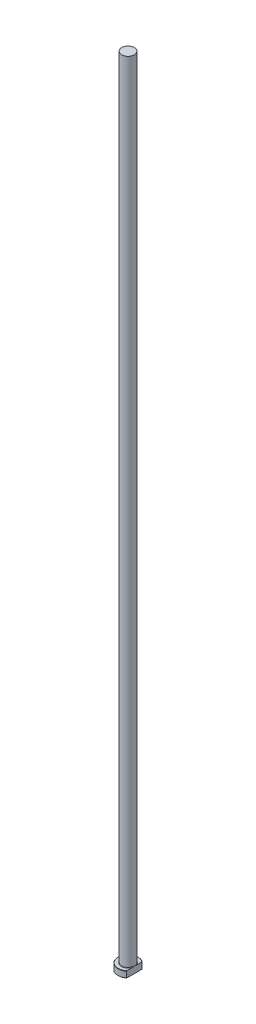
ISO-10303-21;
HEADER;
FILE_DESCRIPTION(('STEP AP214'),'2;1');
FILE_NAME('part.step','',(''),(''),'','','');
FILE_SCHEMA(('AUTOMOTIVE_DESIGN { 1 0 10303 214 1 1 1 1 }'));
ENDSEC;
DATA;
#1=APPLICATION_CONTEXT('core data for automotive mechanical design processes');
#2=APPLICATION_PROTOCOL_DEFINITION('international standard','automotive_design',2000,#1);
#3=PRODUCT_CONTEXT('',#1,'mechanical');
#4=PRODUCT('Part','Part','',(#3));
#5=PRODUCT_RELATED_PRODUCT_CATEGORY('part','',(#4));
#6=PRODUCT_DEFINITION_FORMATION('','',#4);
#7=PRODUCT_DEFINITION_CONTEXT('part definition',#1,'design');
#8=PRODUCT_DEFINITION('design','',#6,#7);
#9=PRODUCT_DEFINITION_SHAPE('','',#8);
#10=(LENGTH_UNIT() NAMED_UNIT(*) SI_UNIT(.MILLI.,.METRE.));
#11=(NAMED_UNIT(*) PLANE_ANGLE_UNIT() SI_UNIT($,.RADIAN.));
#12=(NAMED_UNIT(*) SI_UNIT($,.STERADIAN.) SOLID_ANGLE_UNIT());
#13=UNCERTAINTY_MEASURE_WITH_UNIT(LENGTH_MEASURE(1.E-05),#10,'distance_accuracy_value','');
#14=(GEOMETRIC_REPRESENTATION_CONTEXT(3) GLOBAL_UNCERTAINTY_ASSIGNED_CONTEXT((#13)) GLOBAL_UNIT_ASSIGNED_CONTEXT((#10,
#11,#12)) REPRESENTATION_CONTEXT('',''));
#15=CARTESIAN_POINT('',(0.,0.,0.));
#16=DIRECTION('',(0.,0.,1.));
#17=DIRECTION('',(1.,0.,0.));
#18=AXIS2_PLACEMENT_3D('',#15,#16,#17);
#19=CARTESIAN_POINT('',(0.,0.,0.));
#20=DIRECTION('',(0.,-1.,0.));
#21=DIRECTION('',(0.,0.,-1.));
#22=AXIS2_PLACEMENT_3D('',#19,#20,#21);
#23=PLANE('',#22);
#24=CARTESIAN_POINT('',(0.,0.,0.));
#25=DIRECTION('',(0.,-1.,0.));
#26=DIRECTION('',(0.,0.,-1.));
#27=AXIS2_PLACEMENT_3D('',#24,#25,#26);
#28=CIRCLE('',#27,7.79999999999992);
#29=CARTESIAN_POINT('',(4.99999999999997,0.,5.98665181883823));
#30=VERTEX_POINT('',#29);
#31=CARTESIAN_POINT('',(4.99999999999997,0.,-5.98665181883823));
#32=VERTEX_POINT('',#31);
#33=EDGE_CURVE('E98',#30,#32,#28,.T.);
#34=ORIENTED_EDGE('',*,*,#33,.T.);
#35=DIRECTION('',(0.,0.,1.));
#36=VECTOR('',#35,1.);
#37=CARTESIAN_POINT('',(4.99999999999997,0.,-6.24499799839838));
#38=LINE('',#37,#36);
#39=EDGE_CURVE('E83',#32,#30,#38,.T.);
#40=ORIENTED_EDGE('',*,*,#39,.T.);
#41=EDGE_LOOP('',(#34,#40));
#42=FACE_BOUND('',#41,.T.);
#43=ADVANCED_FACE('F32',(#42),#23,.T.);
#44=CARTESIAN_POINT('',(0.,259.958771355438,0.));
#45=DIRECTION('',(0.,1.,0.));
#46=DIRECTION('',(0.,0.,1.));
#47=AXIS2_PLACEMENT_3D('',#44,#45,#46);
#48=CYLINDRICAL_SURFACE('',#47,7.99999999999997);
#49=CARTESIAN_POINT('',(0.,4.79999999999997,0.));
#50=DIRECTION('',(0.,1.,0.));
#51=DIRECTION('',(0.,0.,1.));
#52=AXIS2_PLACEMENT_3D('',#49,#50,#51);
#53=CIRCLE('',#52,7.99999999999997);
#54=CARTESIAN_POINT('',(4.99999999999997,4.79999999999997,6.24499799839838));
#55=VERTEX_POINT('',#54);
#56=CARTESIAN_POINT('',(4.99999999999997,4.79999999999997,-6.24499799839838));
#57=VERTEX_POINT('',#56);
#58=EDGE_CURVE('E104',#55,#57,#53,.F.);
#59=ORIENTED_EDGE('',*,*,#58,.T.);
#60=DIRECTION('',(0.,-1.,0.));
#61=VECTOR('',#60,1.);
#62=CARTESIAN_POINT('',(4.99999999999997,630.,-6.24499799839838));
#63=LINE('',#62,#61);
#64=CARTESIAN_POINT('',(4.99999999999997,0.200000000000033,-6.24499799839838));
#65=VERTEX_POINT('',#64);
#66=EDGE_CURVE('E183',#57,#65,#63,.T.);
#67=ORIENTED_EDGE('',*,*,#66,.T.);
#68=CARTESIAN_POINT('',(0.,0.200000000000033,0.));
#69=DIRECTION('',(0.,-1.,0.));
#70=DIRECTION('',(0.,0.,-1.));
#71=AXIS2_PLACEMENT_3D('',#68,#69,#70);
#72=CIRCLE('',#71,7.99999999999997);
#73=CARTESIAN_POINT('',(4.99999999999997,0.200000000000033,6.24499799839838));
#74=VERTEX_POINT('',#73);
#75=EDGE_CURVE('E100',#65,#74,#72,.F.);
#76=ORIENTED_EDGE('',*,*,#75,.T.);
#77=DIRECTION('',(0.,-1.,0.));
#78=VECTOR('',#77,1.);
#79=CARTESIAN_POINT('',(4.99999999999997,630.,6.24499799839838));
#80=LINE('',#79,#78);
#81=EDGE_CURVE('E93',#55,#74,#80,.T.);
#82=ORIENTED_EDGE('',*,*,#81,.F.);
#83=EDGE_LOOP('',(#59,#67,#76,#82));
#84=FACE_BOUND('',#83,.T.);
#85=ADVANCED_FACE('F158',(#84),#48,.T.);
#86=CARTESIAN_POINT('',(-7.99999999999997,5.,0.));
#87=DIRECTION('',(0.,1.,0.));
#88=DIRECTION('',(0.,0.,1.));
#89=AXIS2_PLACEMENT_3D('',#86,#87,#88);
#90=PLANE('',#89);
#91=CARTESIAN_POINT('',(0.,5.,0.));
#92=DIRECTION('',(0.,1.,0.));
#93=DIRECTION('',(0.,0.,1.));
#94=AXIS2_PLACEMENT_3D('',#91,#92,#93);
#95=CIRCLE('',#94,7.79999999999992);
#96=CARTESIAN_POINT('',(4.99999999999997,5.,-5.98665181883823));
#97=VERTEX_POINT('',#96);
#98=CARTESIAN_POINT('',(4.99999999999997,5.,5.98665181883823));
#99=VERTEX_POINT('',#98);
#100=EDGE_CURVE('E178',#97,#99,#95,.T.);
#101=ORIENTED_EDGE('',*,*,#100,.T.);
#102=DIRECTION('',(0.,0.,-1.));
#103=VECTOR('',#102,1.);
#104=CARTESIAN_POINT('',(4.99999999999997,5.,0.));
#105=LINE('',#104,#103);
#106=CARTESIAN_POINT('',(4.99999999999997,4.99999999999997,1.75783958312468));
#107=VERTEX_POINT('',#106);
#108=EDGE_CURVE('E57',#99,#107,#105,.T.);
#109=ORIENTED_EDGE('',*,*,#108,.T.);
#110=CARTESIAN_POINT('',(0.,5.,0.));
#111=DIRECTION('',(0.,1.,0.));
#112=DIRECTION('',(0.,0.,1.));
#113=AXIS2_PLACEMENT_3D('',#110,#111,#112);
#114=CIRCLE('',#113,5.29999999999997);
#115=CARTESIAN_POINT('',(4.99999999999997,4.99999999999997,-1.75783958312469));
#116=VERTEX_POINT('',#115);
#117=EDGE_CURVE('E107',#107,#116,#114,.F.);
#118=ORIENTED_EDGE('',*,*,#117,.T.);
#119=EDGE_CURVE('E136',#116,#97,#105,.T.);
#120=ORIENTED_EDGE('',*,*,#119,.T.);
#121=EDGE_LOOP('',(#101,#109,#118,#120));
#122=FACE_BOUND('',#121,.T.);
#123=ADVANCED_FACE('F147',(#122),#90,.T.);
#124=CARTESIAN_POINT('',(0.,5.,0.));
#125=DIRECTION('',(0.,-1.,0.));
#126=DIRECTION('',(0.,0.,-1.));
#127=AXIS2_PLACEMENT_3D('',#124,#125,#126);
#128=CONICAL_SURFACE('',#127,7.79999999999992,0.785398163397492);
#129=ORIENTED_EDGE('',*,*,#58,.F.);
#130=CARTESIAN_POINT('',(4.99999999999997,-1.82162423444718,13.7401563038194));
#131=CARTESIAN_POINT('',(4.99999999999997,-1.61889813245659,13.5244204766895));
#132=CARTESIAN_POINT('',(4.99999999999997,-1.41646387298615,13.3084101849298));
#133=CARTESIAN_POINT('',(4.99999999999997,-1.01227657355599,12.8757508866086));
#134=CARTESIAN_POINT('',(4.99999999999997,-0.810523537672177,12.65910187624));
#135=CARTESIAN_POINT('',(4.99999999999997,-0.206157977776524,12.0077661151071));
#136=CARTESIAN_POINT('',(4.99999999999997,0.195280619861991,11.571988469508));
#137=CARTESIAN_POINT('',(4.99999999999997,1.00388282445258,10.6856136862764));
#138=CARTESIAN_POINT('',(4.99999999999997,1.41093902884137,10.234918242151));
#139=CARTESIAN_POINT('',(4.99999999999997,2.01658324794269,9.55471676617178));
#140=CARTESIAN_POINT('',(4.99999999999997,2.21758236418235,9.32735800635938));
#141=CARTESIAN_POINT('',(4.99999999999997,2.61761142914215,8.87091599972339));
#142=CARTESIAN_POINT('',(4.99999999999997,2.81664139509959,8.6418327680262));
#143=CARTESIAN_POINT('',(4.99999999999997,3.2121734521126,8.18170099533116));
#144=CARTESIAN_POINT('',(4.99999999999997,3.40867681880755,7.95065355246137));
#145=CARTESIAN_POINT('',(4.99999999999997,3.79865427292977,7.48599989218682));
#146=CARTESIAN_POINT('',(4.99999999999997,3.99212827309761,7.25239360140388));
#147=CARTESIAN_POINT('',(4.99999999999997,4.3755816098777,6.78155890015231));
#148=CARTESIAN_POINT('',(4.99999999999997,4.56555334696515,6.54432428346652));
#149=CARTESIAN_POINT('',(4.99999999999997,4.9404213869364,6.06589574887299));
#150=CARTESIAN_POINT('',(4.99999999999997,5.12531810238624,5.82470215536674));
#151=CARTESIAN_POINT('',(4.99999999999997,5.48653546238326,5.33972956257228));
#152=CARTESIAN_POINT('',(4.99999999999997,5.66292392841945,5.09600137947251));
#153=CARTESIAN_POINT('',(4.99999999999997,6.00675382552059,4.60213647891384));
#154=CARTESIAN_POINT('',(4.99999999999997,6.17419169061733,4.35199726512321));
#155=CARTESIAN_POINT('',(4.99999999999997,6.49592993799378,3.84445040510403));
#156=CARTESIAN_POINT('',(4.99999999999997,6.65027272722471,3.5870701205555));
#157=CARTESIAN_POINT('',(4.99999999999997,6.86813414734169,3.19356592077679));
#158=CARTESIAN_POINT('',(4.99999999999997,6.9384553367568,3.06120993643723));
#159=CARTESIAN_POINT('',(4.99999999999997,7.07360441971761,2.7937331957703));
#160=CARTESIAN_POINT('',(4.99999999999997,7.1384331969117,2.65861288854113));
#161=CARTESIAN_POINT('',(4.99999999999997,7.26869642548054,2.36936389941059));
#162=CARTESIAN_POINT('',(4.99999999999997,7.33331212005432,2.21486278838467));
#163=CARTESIAN_POINT('',(4.99999999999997,7.45243473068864,1.90194073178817));
#164=CARTESIAN_POINT('',(4.99999999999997,7.5069400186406,1.74351915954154));
#165=CARTESIAN_POINT('',(4.99999999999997,7.60343746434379,1.42384276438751));
#166=CARTESIAN_POINT('',(4.99999999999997,7.64549910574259,1.26260921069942));
#167=CARTESIAN_POINT('',(4.99999999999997,7.71543089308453,0.937062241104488));
#168=CARTESIAN_POINT('',(4.99999999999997,7.74330266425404,0.772749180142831));
#169=CARTESIAN_POINT('',(4.99999999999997,7.78344284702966,0.439876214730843));
#170=CARTESIAN_POINT('',(4.99999999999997,7.79548961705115,0.271289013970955));
#171=CARTESIAN_POINT('',(4.99999999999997,7.80240809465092,-0.0662275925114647));
#172=CARTESIAN_POINT('',(4.99999999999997,7.79728142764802,-0.235156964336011));
#173=CARTESIAN_POINT('',(4.99999999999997,7.77017954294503,-0.572209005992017));
#174=CARTESIAN_POINT('',(4.99999999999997,7.74814735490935,-0.74032700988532));
#175=CARTESIAN_POINT('',(4.99999999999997,7.68863212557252,-1.07379849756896));
#176=CARTESIAN_POINT('',(4.99999999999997,7.65114437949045,-1.23915112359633));
#177=CARTESIAN_POINT('',(4.99999999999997,7.54734433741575,-1.62344926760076));
#178=CARTESIAN_POINT('',(4.99999999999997,7.475535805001,-1.84089917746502));
#179=CARTESIAN_POINT('',(4.99999999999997,7.31300119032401,-2.26856946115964));
#180=CARTESIAN_POINT('',(4.99999999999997,7.22226460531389,-2.47878574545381));
#181=CARTESIAN_POINT('',(4.99999999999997,7.07492970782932,-2.79014067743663));
#182=CARTESIAN_POINT('',(4.99999999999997,7.02362278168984,-2.89384077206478));
#183=CARTESIAN_POINT('',(4.99999999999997,6.91783840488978,-3.09961626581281));
#184=CARTESIAN_POINT('',(4.99999999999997,6.86336091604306,-3.20169164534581));
#185=CARTESIAN_POINT('',(4.99999999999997,6.75169048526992,-3.40428995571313));
#186=CARTESIAN_POINT('',(4.99999999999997,6.69449856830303,-3.50481345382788));
#187=CARTESIAN_POINT('',(4.99999999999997,6.57774196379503,-3.70446206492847));
#188=CARTESIAN_POINT('',(4.99999999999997,6.51817739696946,-3.80358724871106));
#189=CARTESIAN_POINT('',(4.99999999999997,6.30853654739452,-4.1443576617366));
#190=CARTESIAN_POINT('',(4.99999999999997,6.15326588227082,-4.3828135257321));
#191=CARTESIAN_POINT('',(4.99999999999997,5.83377190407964,-4.85367607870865));
#192=CARTESIAN_POINT('',(4.99999999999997,5.66954595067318,-5.08608095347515));
#193=CARTESIAN_POINT('',(4.99999999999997,5.33431698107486,-5.5462855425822));
#194=CARTESIAN_POINT('',(4.99999999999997,5.16330740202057,-5.77408045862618));
#195=CARTESIAN_POINT('',(4.99999999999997,4.81629923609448,-6.22578157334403));
#196=CARTESIAN_POINT('',(4.99999999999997,4.64030119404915,-6.44968819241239));
#197=CARTESIAN_POINT('',(4.99999999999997,4.28368615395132,-6.89532578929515));
#198=CARTESIAN_POINT('',(4.99999999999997,4.1030528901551,-7.11704371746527));
#199=CARTESIAN_POINT('',(4.99999999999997,3.73870710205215,-7.55793799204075));
#200=CARTESIAN_POINT('',(4.99999999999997,3.55499450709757,-7.77711427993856));
#201=CARTESIAN_POINT('',(4.99999999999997,3.18521083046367,-8.21325328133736));
#202=CARTESIAN_POINT('',(4.99999999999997,2.99914113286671,-8.43021717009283));
#203=CARTESIAN_POINT('',(4.99999999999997,2.62499812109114,-8.86241167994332));
#204=CARTESIAN_POINT('',(4.99999999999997,2.43692478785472,-9.07764228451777));
#205=CARTESIAN_POINT('',(4.99999999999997,1.91463404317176,-9.67075518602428));
#206=CARTESIAN_POINT('',(4.99999999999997,1.57868086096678,-10.0471086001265));
#207=CARTESIAN_POINT('',(4.99999999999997,0.903003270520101,-10.7965122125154));
#208=CARTESIAN_POINT('',(4.99999999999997,0.563278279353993,-11.1695618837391));
#209=CARTESIAN_POINT('',(4.99999999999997,-0.116149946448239,-11.9100168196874));
#210=CARTESIAN_POINT('',(4.99999999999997,-0.455830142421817,-12.2774432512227));
#211=CARTESIAN_POINT('',(4.99999999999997,-1.13728640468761,-13.0102135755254));
#212=CARTESIAN_POINT('',(4.99999999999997,-1.47906204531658,-13.3755578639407));
#213=CARTESIAN_POINT('',(4.99999999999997,-1.82162423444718,-13.7401563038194));
#214=B_SPLINE_CURVE_WITH_KNOTS('',3,(#130,#131,#132,#133,#134,#135,#136,#137,#138,#139,#140,
#141,#142,#143,#144,#145,#146,#147,#148,#149,#150,#151,#152,#153,#154,#155,#156,#157,#158,#159,
#160,#161,#162,#163,#164,#165,#166,#167,#168,#169,#170,#171,#172,#173,#174,#175,#176,#177,#178,
#179,#180,#181,#182,#183,#184,#185,#186,#187,#188,#189,#190,#191,#192,#193,#194,#195,#196,#197,
#198,#199,#200,#201,#202,#203,#204,#205,#206,#207,#208,#209,#210,#211,#212,#213),.UNSPECIFIED.,
.F.,.F.,(4,2,2,2,2,2,2,2,2,2,2,2,2,2,2,2,2,2,2,2,2,2,2,2,2,2,2,2,2,2,2,2,2,2,2,2,2,2,2,2,2,4),
(0.,0.888120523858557,1.77624635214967,3.55372511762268,5.37559481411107,6.28598924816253,
7.19637570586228,8.10628289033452,9.01621623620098,9.92793449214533,10.8395784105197,
11.7420025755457,12.6447836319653,13.5445196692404,13.9940505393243,14.4435089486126,
14.9456212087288,15.4478142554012,15.947147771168,16.4464240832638,16.952621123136,
17.4587702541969,17.966632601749,18.4746496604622,19.1604516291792,19.8466351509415,
20.1936870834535,20.5407431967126,20.8876692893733,21.2345777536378,22.0879097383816,
22.9414946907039,23.79592661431,24.6502655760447,25.5081848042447,26.3661237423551,
27.2235803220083,28.0810450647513,29.5944656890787,31.1081235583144,32.6092678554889,
34.1101167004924),.UNSPECIFIED.);
#215=EDGE_CURVE('E135',#55,#99,#214,.T.);
#216=ORIENTED_EDGE('',*,*,#215,.T.);
#217=ORIENTED_EDGE('',*,*,#100,.F.);
#218=EDGE_CURVE('E127',#97,#57,#214,.T.);
#219=ORIENTED_EDGE('',*,*,#218,.T.);
#220=EDGE_LOOP('',(#129,#216,#217,#219));
#221=FACE_BOUND('',#220,.T.);
#222=ADVANCED_FACE('F143',(#221),#128,.T.);
#223=CARTESIAN_POINT('',(0.,0.200000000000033,0.));
#224=DIRECTION('',(0.,1.,0.));
#225=DIRECTION('',(0.,0.,1.));
#226=AXIS2_PLACEMENT_3D('',#223,#224,#225);
#227=CONICAL_SURFACE('',#226,7.99999999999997,0.785398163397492);
#228=ORIENTED_EDGE('',*,*,#75,.F.);
#229=CARTESIAN_POINT('',(4.99999999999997,6.82162423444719,-13.7401563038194));
#230=CARTESIAN_POINT('',(4.99999999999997,6.61889813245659,-13.5244204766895));
#231=CARTESIAN_POINT('',(4.99999999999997,6.41646387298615,-13.3084101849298));
#232=CARTESIAN_POINT('',(4.99999999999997,6.01227657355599,-12.8757508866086));
#233=CARTESIAN_POINT('',(4.99999999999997,5.81052353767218,-12.65910187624));
#234=CARTESIAN_POINT('',(4.99999999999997,5.20615797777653,-12.0077661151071));
#235=CARTESIAN_POINT('',(4.99999999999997,4.80471938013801,-11.571988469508));
#236=CARTESIAN_POINT('',(4.99999999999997,3.99611717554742,-10.6856136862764));
#237=CARTESIAN_POINT('',(4.99999999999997,3.58906097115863,-10.234918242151));
#238=CARTESIAN_POINT('',(4.99999999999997,2.98341675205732,-9.55471676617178));
#239=CARTESIAN_POINT('',(4.99999999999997,2.78241763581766,-9.32735800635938));
#240=CARTESIAN_POINT('',(4.99999999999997,2.38238857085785,-8.87091599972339));
#241=CARTESIAN_POINT('',(4.99999999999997,2.18335860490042,-8.6418327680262));
#242=CARTESIAN_POINT('',(4.99999999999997,1.78782654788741,-8.18170099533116));
#243=CARTESIAN_POINT('',(4.99999999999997,1.59132318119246,-7.95065355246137));
#244=CARTESIAN_POINT('',(4.99999999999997,1.20134572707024,-7.48599989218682));
#245=CARTESIAN_POINT('',(4.99999999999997,1.00787172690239,-7.25239360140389));
#246=CARTESIAN_POINT('',(4.99999999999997,0.62441839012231,-6.78155890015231));
#247=CARTESIAN_POINT('',(4.99999999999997,0.434446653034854,-6.54432428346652));
#248=CARTESIAN_POINT('',(4.99999999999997,0.0595786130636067,-6.06589574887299));
#249=CARTESIAN_POINT('',(4.99999999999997,-0.12531810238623,-5.82470215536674));
#250=CARTESIAN_POINT('',(4.99999999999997,-0.486535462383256,-5.33972956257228));
#251=CARTESIAN_POINT('',(4.99999999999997,-0.662923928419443,-5.09600137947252));
#252=CARTESIAN_POINT('',(4.99999999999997,-1.00675382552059,-4.60213647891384));
#253=CARTESIAN_POINT('',(4.99999999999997,-1.17419169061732,-4.35199726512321));
#254=CARTESIAN_POINT('',(4.99999999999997,-1.49592993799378,-3.84445040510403));
#255=CARTESIAN_POINT('',(4.99999999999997,-1.65027272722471,-3.5870701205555));
#256=CARTESIAN_POINT('',(4.99999999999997,-1.86813414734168,-3.19356592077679));
#257=CARTESIAN_POINT('',(4.99999999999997,-1.93845533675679,-3.06120993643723));
#258=CARTESIAN_POINT('',(4.99999999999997,-2.07360441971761,-2.7937331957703));
#259=CARTESIAN_POINT('',(4.99999999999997,-2.1384331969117,-2.65861288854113));
#260=CARTESIAN_POINT('',(4.99999999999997,-2.26869642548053,-2.36936389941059));
#261=CARTESIAN_POINT('',(4.99999999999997,-2.33331212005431,-2.21486278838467));
#262=CARTESIAN_POINT('',(4.99999999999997,-2.45243473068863,-1.90194073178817));
#263=CARTESIAN_POINT('',(4.99999999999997,-2.50694001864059,-1.74351915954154));
#264=CARTESIAN_POINT('',(4.99999999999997,-2.60343746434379,-1.42384276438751));
#265=CARTESIAN_POINT('',(4.99999999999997,-2.64549910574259,-1.26260921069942));
#266=CARTESIAN_POINT('',(4.99999999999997,-2.71543089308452,-0.937062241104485));
#267=CARTESIAN_POINT('',(4.99999999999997,-2.74330266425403,-0.772749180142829));
#268=CARTESIAN_POINT('',(4.99999999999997,-2.78344284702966,-0.439876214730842));
#269=CARTESIAN_POINT('',(4.99999999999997,-2.79548961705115,-0.271289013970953));
#270=CARTESIAN_POINT('',(4.99999999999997,-2.80240809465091,0.0662275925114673));
#271=CARTESIAN_POINT('',(4.99999999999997,-2.79728142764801,0.235156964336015));
#272=CARTESIAN_POINT('',(4.99999999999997,-2.77017954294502,0.572209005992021));
#273=CARTESIAN_POINT('',(4.99999999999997,-2.74814735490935,0.740327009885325));
#274=CARTESIAN_POINT('',(4.99999999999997,-2.68863212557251,1.07379849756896));
#275=CARTESIAN_POINT('',(4.99999999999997,-2.65114437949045,1.23915112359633));
#276=CARTESIAN_POINT('',(4.99999999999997,-2.54734433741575,1.62344926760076));
#277=CARTESIAN_POINT('',(4.99999999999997,-2.475535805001,1.84089917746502));
#278=CARTESIAN_POINT('',(4.99999999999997,-2.31300119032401,2.26856946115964));
#279=CARTESIAN_POINT('',(4.99999999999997,-2.22226460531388,2.47878574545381));
#280=CARTESIAN_POINT('',(4.99999999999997,-2.07492970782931,2.79014067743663));
#281=CARTESIAN_POINT('',(4.99999999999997,-2.02362278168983,2.89384077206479));
#282=CARTESIAN_POINT('',(4.99999999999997,-1.91783840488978,3.09961626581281));
#283=CARTESIAN_POINT('',(4.99999999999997,-1.86336091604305,3.20169164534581));
#284=CARTESIAN_POINT('',(4.99999999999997,-1.75169048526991,3.40428995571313));
#285=CARTESIAN_POINT('',(4.99999999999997,-1.69449856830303,3.50481345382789));
#286=CARTESIAN_POINT('',(4.99999999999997,-1.57774196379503,3.70446206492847));
#287=CARTESIAN_POINT('',(4.99999999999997,-1.51817739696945,3.80358724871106));
#288=CARTESIAN_POINT('',(4.99999999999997,-1.30853654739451,4.14435766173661));
#289=CARTESIAN_POINT('',(4.99999999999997,-1.15326588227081,4.38281352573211));
#290=CARTESIAN_POINT('',(4.99999999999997,-0.833771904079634,4.85367607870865));
#291=CARTESIAN_POINT('',(4.99999999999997,-0.669545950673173,5.08608095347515));
#292=CARTESIAN_POINT('',(4.99999999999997,-0.334316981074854,5.5462855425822));
#293=CARTESIAN_POINT('',(4.99999999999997,-0.163307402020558,5.77408045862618));
#294=CARTESIAN_POINT('',(4.99999999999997,0.183700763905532,6.22578157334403));
#295=CARTESIAN_POINT('',(4.99999999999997,0.359698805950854,6.4496881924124));
#296=CARTESIAN_POINT('',(4.99999999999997,0.716313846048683,6.89532578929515));
#297=CARTESIAN_POINT('',(4.99999999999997,0.896947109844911,7.11704371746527));
#298=CARTESIAN_POINT('',(4.99999999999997,1.26129289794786,7.55793799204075));
#299=CARTESIAN_POINT('',(4.99999999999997,1.44500549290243,7.77711427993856));
#300=CARTESIAN_POINT('',(4.99999999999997,1.81478916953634,8.21325328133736));
#301=CARTESIAN_POINT('',(4.99999999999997,2.0008588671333,8.43021717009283));
#302=CARTESIAN_POINT('',(4.99999999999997,2.37500187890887,8.86241167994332));
#303=CARTESIAN_POINT('',(4.99999999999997,2.56307521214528,9.07764228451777));
#304=CARTESIAN_POINT('',(4.99999999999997,3.08536595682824,9.67075518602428));
#305=CARTESIAN_POINT('',(4.99999999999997,3.42131913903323,10.0471086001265));
#306=CARTESIAN_POINT('',(4.99999999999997,4.0969967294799,10.7965122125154));
#307=CARTESIAN_POINT('',(4.99999999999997,4.43672172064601,11.1695618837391));
#308=CARTESIAN_POINT('',(4.99999999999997,5.11614994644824,11.9100168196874));
#309=CARTESIAN_POINT('',(4.99999999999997,5.45583014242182,12.2774432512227));
#310=CARTESIAN_POINT('',(4.99999999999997,6.13728640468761,13.0102135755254));
#311=CARTESIAN_POINT('',(4.99999999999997,6.47906204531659,13.3755578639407));
#312=CARTESIAN_POINT('',(4.99999999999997,6.82162423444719,13.7401563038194));
#313=B_SPLINE_CURVE_WITH_KNOTS('',3,(#229,#230,#231,#232,#233,#234,#235,#236,#237,#238,#239,
#240,#241,#242,#243,#244,#245,#246,#247,#248,#249,#250,#251,#252,#253,#254,#255,#256,#257,#258,
#259,#260,#261,#262,#263,#264,#265,#266,#267,#268,#269,#270,#271,#272,#273,#274,#275,#276,#277,
#278,#279,#280,#281,#282,#283,#284,#285,#286,#287,#288,#289,#290,#291,#292,#293,#294,#295,#296,
#297,#298,#299,#300,#301,#302,#303,#304,#305,#306,#307,#308,#309,#310,#311,#312),.UNSPECIFIED.,
.F.,.F.,(4,2,2,2,2,2,2,2,2,2,2,2,2,2,2,2,2,2,2,2,2,2,2,2,2,2,2,2,2,2,2,2,2,2,2,2,2,2,2,2,2,4),
(0.,0.888120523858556,1.77624635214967,3.55372511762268,5.37559481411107,6.28598924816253,
7.19637570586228,8.10628289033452,9.01621623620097,9.92793449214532,10.8395784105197,
11.7420025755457,12.6447836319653,13.5445196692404,13.9940505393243,14.4435089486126,
14.9456212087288,15.4478142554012,15.947147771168,16.4464240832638,16.952621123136,
17.4587702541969,17.966632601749,18.4746496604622,19.1604516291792,19.8466351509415,
20.1936870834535,20.5407431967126,20.8876692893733,21.2345777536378,22.0879097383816,
22.9414946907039,23.79592661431,24.6502655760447,25.5081848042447,26.3661237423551,
27.2235803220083,28.0810450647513,29.5944656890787,31.1081235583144,32.6092678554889,
34.1101167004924),.UNSPECIFIED.);
#314=EDGE_CURVE('E86',#65,#32,#313,.T.);
#315=ORIENTED_EDGE('',*,*,#314,.T.);
#316=ORIENTED_EDGE('',*,*,#33,.F.);
#317=EDGE_CURVE('E89',#30,#74,#313,.T.);
#318=ORIENTED_EDGE('',*,*,#317,.T.);
#319=EDGE_LOOP('',(#228,#315,#316,#318));
#320=FACE_BOUND('',#319,.T.);
#321=ADVANCED_FACE('F97',(#320),#227,.T.);
#322=CARTESIAN_POINT('',(0.,5.29999999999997,0.));
#323=DIRECTION('',(0.,1.,0.));
#324=DIRECTION('',(0.,0.,1.));
#325=AXIS2_PLACEMENT_3D('',#322,#323,#324);
#326=TOROIDAL_SURFACE('',#325,5.29999999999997,0.3);
#327=CARTESIAN_POINT('',(4.99999999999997,5.29999999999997,0.));
#328=CARTESIAN_POINT('',(4.99999999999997,5.30000062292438,1.31470000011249E-10));
#329=CARTESIAN_POINT('',(4.99999999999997,5.30000124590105,-2.52759208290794E-07));
#330=CARTESIAN_POINT('',(4.99999999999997,5.30000240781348,-9.4716432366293E-07));
#331=CARTESIAN_POINT('',(4.99999999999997,5.30000293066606,-1.40594035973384E-06));
#332=CARTESIAN_POINT('',(4.99999999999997,5.30000402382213,-2.50637603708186E-06));
#333=CARTESIAN_POINT('',(4.99999999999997,5.30000457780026,-3.16588904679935E-06));
#334=CARTESIAN_POINT('',(4.99999999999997,5.30000556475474,-4.52859961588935E-06));
#335=CARTESIAN_POINT('',(4.99999999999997,5.30000600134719,-5.22939444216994E-06));
#336=CARTESIAN_POINT('',(4.99999999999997,5.30000763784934,-7.96121978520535E-06));
#337=CARTESIAN_POINT('',(4.99999999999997,5.30000875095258,-1.0047740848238E-05));
#338=CARTESIAN_POINT('',(4.99999999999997,5.30001056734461,-1.41660873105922E-05));
#339=CARTESIAN_POINT('',(4.99999999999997,5.30001129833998,-1.61861783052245E-05));
#340=CARTESIAN_POINT('',(4.99999999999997,5.30001439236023,-2.47865739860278E-05));
#341=CARTESIAN_POINT('',(4.99999999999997,5.30001672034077,-3.1383028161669E-05));
#342=CARTESIAN_POINT('',(4.99999999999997,5.30002012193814,-4.38084218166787E-05));
#343=CARTESIAN_POINT('',(4.99999999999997,5.30002133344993,-4.95992736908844E-05));
#344=CARTESIAN_POINT('',(4.99999999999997,5.30003020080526,-9.27862610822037E-05));
#345=CARTESIAN_POINT('',(4.99999999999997,5.30003696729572,-0.000130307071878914));
#346=CARTESIAN_POINT('',(4.99999999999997,5.30006659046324,-0.000278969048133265));
#347=CARTESIAN_POINT('',(4.99999999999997,5.30009481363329,-0.000389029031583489));
#348=CARTESIAN_POINT('',(4.99999999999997,5.3002050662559,-0.000826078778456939));
#349=CARTESIAN_POINT('',(4.99999999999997,5.30028365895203,-0.0011536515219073));
#350=CARTESIAN_POINT('',(4.99999999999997,5.300599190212,-0.0024592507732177));
#351=CARTESIAN_POINT('',(4.99999999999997,5.30084048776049,-0.00343651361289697));
#352=CARTESIAN_POINT('',(4.99999999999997,5.3018462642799,-0.00752058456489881));
#353=CARTESIAN_POINT('',(4.99999999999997,5.3026052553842,-0.0106283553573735));
#354=CARTESIAN_POINT('',(4.99999999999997,5.30996461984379,-0.0407482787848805));
#355=CARTESIAN_POINT('',(4.99999999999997,5.31658985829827,-0.0677561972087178));
#356=CARTESIAN_POINT('',(4.99999999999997,5.32953319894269,-0.120688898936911));
#357=CARTESIAN_POINT('',(4.99999999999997,5.33585289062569,-0.146613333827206));
#358=CARTESIAN_POINT('',(4.99999999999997,5.34926050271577,-0.201795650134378));
#359=CARTESIAN_POINT('',(4.99999999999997,5.35634306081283,-0.231054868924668));
#360=CARTESIAN_POINT('',(4.99999999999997,5.37050252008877,-0.289917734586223));
#361=CARTESIAN_POINT('',(4.99999999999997,5.37757848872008,-0.319521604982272));
#362=CARTESIAN_POINT('',(4.99999999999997,5.39452602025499,-0.391032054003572));
#363=CARTESIAN_POINT('',(4.99999999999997,5.40434071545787,-0.432952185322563));
#364=CARTESIAN_POINT('',(4.99999999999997,5.42340141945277,-0.51576321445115));
#365=CARTESIAN_POINT('',(4.99999999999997,5.43265559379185,-0.556652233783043));
#366=CARTESIAN_POINT('',(4.99999999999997,5.45710553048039,-0.667075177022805));
#367=CARTESIAN_POINT('',(4.99999999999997,5.47194176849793,-0.736689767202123));
#368=CARTESIAN_POINT('',(4.99999999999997,5.50018229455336,-0.876836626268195));
#369=CARTESIAN_POINT('',(4.99999999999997,5.51357312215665,-0.947371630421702));
#370=CARTESIAN_POINT('',(4.99999999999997,5.53930921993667,-1.09497328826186));
#371=CARTESIAN_POINT('',(4.99999999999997,5.55146217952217,-1.17207432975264));
#372=CARTESIAN_POINT('',(4.99999999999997,5.57239669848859,-1.32672649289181));
#373=CARTESIAN_POINT('',(4.99999999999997,5.58117877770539,-1.40427754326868));
#374=CARTESIAN_POINT('',(4.99999999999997,5.594997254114,-1.5687382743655));
#375=CARTESIAN_POINT('',(4.99999999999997,5.59948802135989,-1.65570044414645));
#376=CARTESIAN_POINT('',(4.99999999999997,5.60018885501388,-1.78535304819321));
#377=CARTESIAN_POINT('',(4.99999999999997,5.59945214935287,-1.82802575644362));
#378=CARTESIAN_POINT('',(4.99999999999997,5.59559364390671,-1.91325081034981));
#379=CARTESIAN_POINT('',(4.99999999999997,5.59247319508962,-1.95580321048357));
#380=CARTESIAN_POINT('',(4.99999999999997,5.5838324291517,-2.03512365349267));
#381=CARTESIAN_POINT('',(4.99999999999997,5.57867386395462,-2.07192937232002));
#382=CARTESIAN_POINT('',(4.99999999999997,5.56543793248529,-2.1452675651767));
#383=CARTESIAN_POINT('',(4.99999999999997,5.55734203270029,-2.18179676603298));
#384=CARTESIAN_POINT('',(4.99999999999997,5.53718005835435,-2.25427226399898));
#385=CARTESIAN_POINT('',(4.99999999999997,5.52507057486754,-2.29020746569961));
#386=CARTESIAN_POINT('',(4.99999999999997,5.50270928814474,-2.34223029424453));
#387=CARTESIAN_POINT('',(4.99999999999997,5.4945781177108,-2.35922314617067));
#388=CARTESIAN_POINT('',(4.99999999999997,5.47657809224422,-2.39224900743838));
#389=CARTESIAN_POINT('',(4.99999999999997,5.46671281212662,-2.40828390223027));
#390=CARTESIAN_POINT('',(4.99999999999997,5.44695893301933,-2.43579467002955));
#391=CARTESIAN_POINT('',(4.99999999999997,5.4374587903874,-2.44754592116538));
#392=CARTESIAN_POINT('',(4.99999999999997,5.41677914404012,-2.46946476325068));
#393=CARTESIAN_POINT('',(4.99999999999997,5.40560543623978,-2.47963758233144));
#394=CARTESIAN_POINT('',(4.99999999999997,5.38617750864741,-2.49393642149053));
#395=CARTESIAN_POINT('',(4.99999999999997,5.37851643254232,-2.49886271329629));
#396=CARTESIAN_POINT('',(4.99999999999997,5.36252740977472,-2.50749953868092));
#397=CARTESIAN_POINT('',(4.99999999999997,5.35419984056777,-2.51121075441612));
#398=CARTESIAN_POINT('',(4.99999999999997,5.33690648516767,-2.51712941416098));
#399=CARTESIAN_POINT('',(4.99999999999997,5.3279345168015,-2.51931927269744));
#400=CARTESIAN_POINT('',(4.99999999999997,5.30973576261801,-2.52185978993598));
#401=CARTESIAN_POINT('',(4.99999999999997,5.30050931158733,-2.52221275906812));
#402=CARTESIAN_POINT('',(4.99999999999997,5.28349166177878,-2.52112455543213));
#403=CARTESIAN_POINT('',(4.99999999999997,5.27568322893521,-2.519931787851));
#404=CARTESIAN_POINT('',(4.99999999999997,5.26036860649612,-2.51628294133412));
#405=CARTESIAN_POINT('',(4.99999999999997,5.25286261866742,-2.51382603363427));
#406=CARTESIAN_POINT('',(4.99999999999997,5.23590266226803,-2.50685484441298));
#407=CARTESIAN_POINT('',(4.99999999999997,5.22661875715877,-2.50192984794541));
#408=CARTESIAN_POINT('',(4.99999999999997,5.20895514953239,-2.49066548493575));
#409=CARTESIAN_POINT('',(4.99999999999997,5.20057756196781,-2.48432291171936));
#410=CARTESIAN_POINT('',(4.99999999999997,5.1798700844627,-2.46645212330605));
#411=CARTESIAN_POINT('',(4.99999999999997,5.1682415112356,-2.45411867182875));
#412=CARTESIAN_POINT('',(4.99999999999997,5.14692461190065,-2.42790849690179));
#413=CARTESIAN_POINT('',(4.99999999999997,5.13723987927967,-2.41402898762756));
#414=CARTESIAN_POINT('',(4.99999999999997,5.11080706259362,-2.37143175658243));
#415=CARTESIAN_POINT('',(4.99999999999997,5.09628770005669,-2.34134703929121));
#416=CARTESIAN_POINT('',(4.99999999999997,5.07130349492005,-2.27940731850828));
#417=CARTESIAN_POINT('',(4.99999999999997,5.06087110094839,-2.24754035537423));
#418=CARTESIAN_POINT('',(4.99999999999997,5.03890359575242,-2.16787245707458));
#419=CARTESIAN_POINT('',(4.99999999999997,5.02913523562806,-2.1195906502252));
#420=CARTESIAN_POINT('',(4.99999999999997,5.01416953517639,-2.02224928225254));
#421=CARTESIAN_POINT('',(4.99999999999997,5.00898637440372,-1.97318778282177));
#422=CARTESIAN_POINT('',(4.99999999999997,5.00220823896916,-1.87635767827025));
#423=CARTESIAN_POINT('',(4.99999999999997,5.00050709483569,-1.82859609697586));
#424=CARTESIAN_POINT('',(4.99999999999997,4.99969104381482,-1.73330165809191));
#425=CARTESIAN_POINT('',(4.99999999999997,5.00056327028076,-1.68576884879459));
#426=CARTESIAN_POINT('',(4.99999999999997,5.0048429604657,-1.57937770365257));
#427=CARTESIAN_POINT('',(4.99999999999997,5.00880932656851,-1.52054285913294));
#428=CARTESIAN_POINT('',(4.99999999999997,5.01925964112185,-1.40312974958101));
#429=CARTESIAN_POINT('',(4.99999999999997,5.02574264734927,-1.34455139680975));
#430=CARTESIAN_POINT('',(4.99999999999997,5.04090087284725,-1.22627662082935));
#431=CARTESIAN_POINT('',(4.99999999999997,5.0496242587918,-1.16658647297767));
#432=CARTESIAN_POINT('',(4.99999999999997,5.06877923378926,-1.04732463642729));
#433=CARTESIAN_POINT('',(4.99999999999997,5.07921523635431,-0.987753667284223));
#434=CARTESIAN_POINT('',(4.99999999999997,5.10551698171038,-0.846936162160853));
#435=CARTESIAN_POINT('',(4.99999999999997,5.12196565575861,-0.765799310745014));
#436=CARTESIAN_POINT('',(4.99999999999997,5.15639716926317,-0.604819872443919));
#437=CARTESIAN_POINT('',(4.99999999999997,5.17436050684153,-0.524973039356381));
#438=CARTESIAN_POINT('',(4.99999999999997,5.20921667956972,-0.374726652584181));
#439=CARTESIAN_POINT('',(4.99999999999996,5.22599388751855,-0.304300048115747));
#440=CARTESIAN_POINT('',(4.99999999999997,5.2519110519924,-0.196907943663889));
#441=CARTESIAN_POINT('',(4.99999999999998,5.26090146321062,-0.159905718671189));
#442=CARTESIAN_POINT('',(4.99999999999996,5.27881854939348,-0.0865164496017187));
#443=CARTESIAN_POINT('',(4.99999999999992,5.28774391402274,-0.0501291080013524));
#444=CARTESIAN_POINT('',(4.99999999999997,5.29739627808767,-0.0106218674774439));
#445=CARTESIAN_POINT('',(4.99999999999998,5.2981568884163,-0.00750762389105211));
#446=CARTESIAN_POINT('',(4.99999999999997,5.2991630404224,-0.00342209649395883));
#447=CARTESIAN_POINT('',(4.99999999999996,5.29940309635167,-0.00244985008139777));
#448=CARTESIAN_POINT('',(4.99999999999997,5.29971711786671,-0.00115049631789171));
#449=CARTESIAN_POINT('',(4.99999999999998,5.299795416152,-0.000824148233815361));
#450=CARTESIAN_POINT('',(4.99999999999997,5.2999053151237,-0.000388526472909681));
#451=CARTESIAN_POINT('',(4.99999999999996,5.29993348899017,-0.0002786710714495));
#452=CARTESIAN_POINT('',(4.99999999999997,5.29996306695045,-0.000130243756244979));
#453=CARTESIAN_POINT('',(4.99999999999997,5.29996982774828,-9.2751137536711E-05));
#454=CARTESIAN_POINT('',(4.99999999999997,5.29997868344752,-4.95929887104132E-05));
#455=CARTESIAN_POINT('',(4.99999999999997,5.29997989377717,-4.38036553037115E-05));
#456=CARTESIAN_POINT('',(4.99999999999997,5.29998329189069,-3.13814183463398E-05));
#457=CARTESIAN_POINT('',(4.99999999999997,5.29998561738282,-2.4786521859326E-05));
#458=CARTESIAN_POINT('',(4.99999999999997,5.29998870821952,-1.61877546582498E-05));
#459=CARTESIAN_POINT('',(4.99999999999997,5.29998943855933,-1.41677768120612E-05));
#460=CARTESIAN_POINT('',(4.99999999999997,5.29999125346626,-1.00495530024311E-05));
#461=CARTESIAN_POINT('',(4.99999999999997,5.29999236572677,-7.96302653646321E-06));
#462=CARTESIAN_POINT('',(4.99999999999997,5.29999400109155,-5.23107415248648E-06));
#463=CARTESIAN_POINT('',(4.99999999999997,5.29999443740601,-4.53021031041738E-06));
#464=CARTESIAN_POINT('',(4.99999999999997,5.29999542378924,-3.16731152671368E-06));
#465=CARTESIAN_POINT('',(4.99999999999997,5.29999597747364,-2.50767725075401E-06));
#466=CARTESIAN_POINT('',(4.99999999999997,5.29999707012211,-1.40695877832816E-06));
#467=CARTESIAN_POINT('',(4.99999999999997,5.29999759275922,-9.48032431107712E-07));
#468=CARTESIAN_POINT('',(4.99999999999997,5.29999875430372,-2.53244317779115E-07));
#469=CARTESIAN_POINT('',(4.99999999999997,5.29999937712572,-1.3145941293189E-10));
#470=CARTESIAN_POINT('',(4.99999999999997,5.29999999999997,0.));
#471=B_SPLINE_CURVE_WITH_KNOTS('',3,(#327,#328,#329,#330,#331,#332,#333,#334,#335,#336,#337,
#338,#339,#340,#341,#342,#343,#344,#345,#346,#347,#348,#349,#350,#351,#352,#353,#354,#355,#356,
#357,#358,#359,#360,#361,#362,#363,#364,#365,#366,#367,#368,#369,#370,#371,#372,#373,#374,#375,
#376,#377,#378,#379,#380,#381,#382,#383,#384,#385,#386,#387,#388,#389,#390,#391,#392,#393,#394,
#395,#396,#397,#398,#399,#400,#401,#402,#403,#404,#405,#406,#407,#408,#409,#410,#411,#412,#413,
#414,#415,#416,#417,#418,#419,#420,#421,#422,#423,#424,#425,#426,#427,#428,#429,#430,#431,#432,
#433,#434,#435,#436,#437,#438,#439,#440,#441,#442,#443,#444,#445,#446,#447,#448,#449,#450,#451,
#452,#453,#454,#455,#456,#457,#458,#459,#460,#461,#462,#463,#464,#465,#466,#467,#468,#469,#470),
.UNSPECIFIED.,.T.,.F.,(4,2,2,2,2,2,2,2,2,2,2,2,2,2,2,2,2,2,2,2,2,2,2,2,2,2,2,2,2,2,2,2,2,2,2,2,
2,2,2,2,2,2,2,2,2,2,2,2,2,2,2,2,2,2,2,2,2,2,2,2,2,2,2,2,2,2,2,2,2,2,2,4),(0.,
1.88939317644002E-06,3.98058917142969E-06,6.54818564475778E-06,9.0240439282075E-06,
1.60938750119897E-05,2.25328198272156E-05,4.34843921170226E-05,6.12120199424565E-05,
0.000175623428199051,0.000516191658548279,0.00152710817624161,0.00454656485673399,
0.0141443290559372,0.0975679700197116,0.177619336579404,0.267931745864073,0.35924502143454,
0.488405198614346,0.614173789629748,0.827694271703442,1.04305715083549,1.27715608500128,
1.51121890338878,1.77214751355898,1.9001350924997,2.02805018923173,2.13945459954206,
2.25157451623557,2.36494894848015,2.4213923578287,2.47772074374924,2.52293802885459,
2.56800219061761,2.59524342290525,2.62246933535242,2.65000494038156,2.67750590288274,
2.70108948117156,2.72468854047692,2.75603978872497,2.78746268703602,2.83802806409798,
2.888686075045,2.98834295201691,3.0887757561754,3.23618650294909,3.38405153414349,
3.52733651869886,3.66990630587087,3.84673903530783,4.02350562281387,4.20444776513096,
4.38586374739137,4.63419556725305,4.87971270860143,5.09690175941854,5.21113882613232,
5.32353360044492,5.33315137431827,5.33615533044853,5.33716246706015,5.33750240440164,
5.33761672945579,5.33763445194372,5.33765539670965,5.33766183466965,5.33766890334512,
5.33767137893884,5.3376739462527,5.33767603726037,5.3376779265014),.UNSPECIFIED.);
#472=CARTESIAN_POINT('',(4.99999999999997,5.29999999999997,0.));
#473=VERTEX_POINT('',#472);
#474=EDGE_CURVE('E11',#116,#473,#471,.T.);
#475=ORIENTED_EDGE('',*,*,#474,.F.);
#476=ORIENTED_EDGE('',*,*,#117,.F.);
#477=CARTESIAN_POINT('',(4.99999999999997,5.29999999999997,0.));
#478=CARTESIAN_POINT('',(4.99999999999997,5.29999937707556,-1.31470067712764E-10));
#479=CARTESIAN_POINT('',(4.99999999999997,5.29999875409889,2.5275920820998E-07));
#480=CARTESIAN_POINT('',(4.99999999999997,5.29999759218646,9.4716432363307E-07));
#481=CARTESIAN_POINT('',(4.99999999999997,5.29999706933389,1.40594035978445E-06));
#482=CARTESIAN_POINT('',(4.99999999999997,5.29999597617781,2.5063760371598E-06));
#483=CARTESIAN_POINT('',(4.99999999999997,5.29999542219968,3.16588904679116E-06));
#484=CARTESIAN_POINT('',(4.99999999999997,5.2999944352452,4.52859961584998E-06));
#485=CARTESIAN_POINT('',(4.99999999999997,5.29999399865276,5.22939444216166E-06));
#486=CARTESIAN_POINT('',(4.99999999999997,5.2999923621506,7.96121978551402E-06));
#487=CARTESIAN_POINT('',(4.99999999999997,5.29999124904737,1.00477408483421E-05));
#488=CARTESIAN_POINT('',(4.99999999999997,5.29998943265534,1.41660873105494E-05));
#489=CARTESIAN_POINT('',(4.99999999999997,5.29998870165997,1.61861783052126E-05));
#490=CARTESIAN_POINT('',(4.99999999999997,5.29998560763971,2.47865739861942E-05));
#491=CARTESIAN_POINT('',(4.99999999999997,5.29998327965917,3.13830281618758E-05));
#492=CARTESIAN_POINT('',(4.99999999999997,5.2999798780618,4.38084218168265E-05));
#493=CARTESIAN_POINT('',(4.99999999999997,5.29997866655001,4.95992736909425E-05));
#494=CARTESIAN_POINT('',(4.99999999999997,5.29996979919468,9.27862610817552E-05));
#495=CARTESIAN_POINT('',(4.99999999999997,5.29996303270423,0.000130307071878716));
#496=CARTESIAN_POINT('',(4.99999999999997,5.2999334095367,0.000278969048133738));
#497=CARTESIAN_POINT('',(4.99999999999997,5.29990518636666,0.000389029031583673));
#498=CARTESIAN_POINT('',(4.99999999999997,5.29979493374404,0.000826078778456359));
#499=CARTESIAN_POINT('',(4.99999999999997,5.29971634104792,0.00115365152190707));
#500=CARTESIAN_POINT('',(4.99999999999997,5.29940080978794,0.00245925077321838));
#501=CARTESIAN_POINT('',(4.99999999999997,5.29915951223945,0.00343651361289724));
#502=CARTESIAN_POINT('',(4.99999999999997,5.29815373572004,0.00752058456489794));
#503=CARTESIAN_POINT('',(4.99999999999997,5.29739474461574,0.0106283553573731));
#504=CARTESIAN_POINT('',(4.99999999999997,5.29003538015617,0.040748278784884));
#505=CARTESIAN_POINT('',(4.99999999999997,5.28341014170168,0.0677561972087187));
#506=CARTESIAN_POINT('',(4.99999999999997,5.27046680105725,0.12068889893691));
#507=CARTESIAN_POINT('',(4.99999999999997,5.26414710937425,0.146613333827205));
#508=CARTESIAN_POINT('',(4.99999999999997,5.25073949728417,0.201795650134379));
#509=CARTESIAN_POINT('',(4.99999999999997,5.24365693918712,0.231054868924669));
#510=CARTESIAN_POINT('',(4.99999999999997,5.22949747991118,0.289917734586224));
#511=CARTESIAN_POINT('',(4.99999999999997,5.22242151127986,0.319521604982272));
#512=CARTESIAN_POINT('',(4.99999999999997,5.20547397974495,0.391032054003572));
#513=CARTESIAN_POINT('',(4.99999999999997,5.19565928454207,0.432952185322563));
#514=CARTESIAN_POINT('',(4.99999999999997,5.17659858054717,0.51576321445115));
#515=CARTESIAN_POINT('',(4.99999999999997,5.16734440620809,0.556652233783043));
#516=CARTESIAN_POINT('',(4.99999999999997,5.14289446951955,0.667075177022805));
#517=CARTESIAN_POINT('',(4.99999999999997,5.12805823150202,0.736689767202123));
#518=CARTESIAN_POINT('',(4.99999999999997,5.09981770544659,0.876836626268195));
#519=CARTESIAN_POINT('',(4.99999999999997,5.08642687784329,0.947371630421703));
#520=CARTESIAN_POINT('',(4.99999999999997,5.06069078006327,1.09497328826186));
#521=CARTESIAN_POINT('',(4.99999999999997,5.04853782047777,1.17207432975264));
#522=CARTESIAN_POINT('',(4.99999999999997,5.02760330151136,1.32672649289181));
#523=CARTESIAN_POINT('',(4.99999999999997,5.01882122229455,1.40427754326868));
#524=CARTESIAN_POINT('',(4.99999999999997,5.00500274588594,1.5687382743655));
#525=CARTESIAN_POINT('',(4.99999999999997,5.00051197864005,1.65570044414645));
#526=CARTESIAN_POINT('',(4.99999999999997,4.99981114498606,1.78535304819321));
#527=CARTESIAN_POINT('',(4.99999999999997,5.00054785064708,1.82802575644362));
#528=CARTESIAN_POINT('',(4.99999999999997,5.00440635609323,1.91325081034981));
#529=CARTESIAN_POINT('',(4.99999999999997,5.00752680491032,1.95580321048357));
#530=CARTESIAN_POINT('',(4.99999999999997,5.01616757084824,2.03512365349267));
#531=CARTESIAN_POINT('',(4.99999999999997,5.02132613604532,2.07192937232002));
#532=CARTESIAN_POINT('',(4.99999999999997,5.03456206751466,2.1452675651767));
#533=CARTESIAN_POINT('',(4.99999999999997,5.04265796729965,2.18179676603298));
#534=CARTESIAN_POINT('',(4.99999999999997,5.0628199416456,2.25427226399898));
#535=CARTESIAN_POINT('',(4.99999999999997,5.0749294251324,2.29020746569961));
#536=CARTESIAN_POINT('',(4.99999999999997,5.09729071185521,2.34223029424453));
#537=CARTESIAN_POINT('',(4.99999999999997,5.10542188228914,2.35922314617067));
#538=CARTESIAN_POINT('',(4.99999999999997,5.12342190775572,2.39224900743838));
#539=CARTESIAN_POINT('',(4.99999999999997,5.13328718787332,2.40828390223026));
#540=CARTESIAN_POINT('',(4.99999999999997,5.15304106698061,2.43579467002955));
#541=CARTESIAN_POINT('',(4.99999999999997,5.16254120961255,2.44754592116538));
#542=CARTESIAN_POINT('',(4.99999999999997,5.18322085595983,2.46946476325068));
#543=CARTESIAN_POINT('',(4.99999999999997,5.19439456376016,2.47963758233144));
#544=CARTESIAN_POINT('',(4.99999999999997,5.21382249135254,2.49393642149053));
#545=CARTESIAN_POINT('',(4.99999999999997,5.22148356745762,2.49886271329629));
#546=CARTESIAN_POINT('',(4.99999999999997,5.23747259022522,2.50749953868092));
#547=CARTESIAN_POINT('',(4.99999999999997,5.24580015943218,2.51121075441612));
#548=CARTESIAN_POINT('',(4.99999999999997,5.26309351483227,2.51712941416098));
#549=CARTESIAN_POINT('',(4.99999999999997,5.27206548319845,2.51931927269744));
#550=CARTESIAN_POINT('',(4.99999999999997,5.29026423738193,2.52185978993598));
#551=CARTESIAN_POINT('',(4.99999999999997,5.29949068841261,2.52221275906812));
#552=CARTESIAN_POINT('',(4.99999999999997,5.31650833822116,2.52112455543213));
#553=CARTESIAN_POINT('',(4.99999999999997,5.32431677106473,2.519931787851));
#554=CARTESIAN_POINT('',(4.99999999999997,5.33963139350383,2.51628294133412));
#555=CARTESIAN_POINT('',(4.99999999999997,5.34713738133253,2.51382603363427));
#556=CARTESIAN_POINT('',(4.99999999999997,5.36409733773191,2.50685484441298));
#557=CARTESIAN_POINT('',(4.99999999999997,5.37338124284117,2.50192984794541));
#558=CARTESIAN_POINT('',(4.99999999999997,5.39104485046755,2.49066548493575));
#559=CARTESIAN_POINT('',(4.99999999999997,5.39942243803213,2.48432291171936));
#560=CARTESIAN_POINT('',(4.99999999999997,5.42012991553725,2.46645212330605));
#561=CARTESIAN_POINT('',(4.99999999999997,5.43175848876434,2.45411867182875));
#562=CARTESIAN_POINT('',(4.99999999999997,5.45307538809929,2.42790849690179));
#563=CARTESIAN_POINT('',(4.99999999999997,5.46276012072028,2.41402898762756));
#564=CARTESIAN_POINT('',(4.99999999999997,5.48919293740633,2.37143175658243));
#565=CARTESIAN_POINT('',(4.99999999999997,5.50371229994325,2.34134703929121));
#566=CARTESIAN_POINT('',(4.99999999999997,5.52869650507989,2.27940731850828));
#567=CARTESIAN_POINT('',(4.99999999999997,5.53912889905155,2.24754035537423));
#568=CARTESIAN_POINT('',(4.99999999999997,5.56109640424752,2.16787245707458));
#569=CARTESIAN_POINT('',(4.99999999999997,5.57086476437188,2.1195906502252));
#570=CARTESIAN_POINT('',(4.99999999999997,5.58583046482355,2.02224928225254));
#571=CARTESIAN_POINT('',(4.99999999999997,5.59101362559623,1.97318778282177));
#572=CARTESIAN_POINT('',(4.99999999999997,5.59779176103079,1.87635767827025));
#573=CARTESIAN_POINT('',(4.99999999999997,5.59949290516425,1.82859609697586));
#574=CARTESIAN_POINT('',(4.99999999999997,5.60030895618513,1.73330165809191));
#575=CARTESIAN_POINT('',(4.99999999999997,5.59943672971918,1.68576884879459));
#576=CARTESIAN_POINT('',(4.99999999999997,5.59515703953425,1.57937770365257));
#577=CARTESIAN_POINT('',(4.99999999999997,5.59119067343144,1.52054285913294));
#578=CARTESIAN_POINT('',(4.99999999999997,5.5807403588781,1.40312974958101));
#579=CARTESIAN_POINT('',(4.99999999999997,5.57425735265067,1.34455139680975));
#580=CARTESIAN_POINT('',(4.99999999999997,5.5590991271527,1.22627662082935));
#581=CARTESIAN_POINT('',(4.99999999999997,5.55037574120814,1.16658647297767));
#582=CARTESIAN_POINT('',(4.99999999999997,5.53122076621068,1.04732463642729));
#583=CARTESIAN_POINT('',(4.99999999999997,5.52078476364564,0.987753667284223));
#584=CARTESIAN_POINT('',(4.99999999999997,5.49448301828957,0.846936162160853));
#585=CARTESIAN_POINT('',(4.99999999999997,5.47803434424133,0.765799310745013));
#586=CARTESIAN_POINT('',(4.99999999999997,5.44360283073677,0.604819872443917));
#587=CARTESIAN_POINT('',(4.99999999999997,5.42563949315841,0.52497303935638));
#588=CARTESIAN_POINT('',(4.99999999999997,5.39078332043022,0.374726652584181));
#589=CARTESIAN_POINT('',(4.99999999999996,5.37400611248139,0.304300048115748));
#590=CARTESIAN_POINT('',(4.99999999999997,5.34808894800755,0.19690794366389));
#591=CARTESIAN_POINT('',(4.99999999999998,5.33909853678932,0.159905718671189));
#592=CARTESIAN_POINT('',(4.99999999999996,5.32118145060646,0.0865164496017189));
#593=CARTESIAN_POINT('',(4.99999999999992,5.31225608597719,0.0501291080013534));
#594=CARTESIAN_POINT('',(4.99999999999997,5.30260372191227,0.0106218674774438));
#595=CARTESIAN_POINT('',(4.99999999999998,5.30184311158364,0.00750762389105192));
#596=CARTESIAN_POINT('',(4.99999999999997,5.30083695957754,0.00342209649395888));
#597=CARTESIAN_POINT('',(4.99999999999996,5.30059690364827,0.00244985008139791));
#598=CARTESIAN_POINT('',(4.99999999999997,5.30028288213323,0.00115049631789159));
#599=CARTESIAN_POINT('',(4.99999999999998,5.30020458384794,0.000824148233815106));
#600=CARTESIAN_POINT('',(4.99999999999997,5.30009468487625,0.000388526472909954));
#601=CARTESIAN_POINT('',(4.99999999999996,5.30006651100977,0.000278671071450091));
#602=CARTESIAN_POINT('',(4.99999999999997,5.30003693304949,0.000130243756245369));
#603=CARTESIAN_POINT('',(4.99999999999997,5.30003017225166,9.27511375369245E-05));
#604=CARTESIAN_POINT('',(4.99999999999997,5.30002131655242,4.95929887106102E-05));
#605=CARTESIAN_POINT('',(4.99999999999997,5.30002010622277,4.38036553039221E-05));
#606=CARTESIAN_POINT('',(4.99999999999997,5.30001670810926,3.13814183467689E-05));
#607=CARTESIAN_POINT('',(4.99999999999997,5.30001438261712,2.47865218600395E-05));
#608=CARTESIAN_POINT('',(4.99999999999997,5.30001129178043,1.61877546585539E-05));
#609=CARTESIAN_POINT('',(4.99999999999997,5.30001056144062,1.41677768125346E-05));
#610=CARTESIAN_POINT('',(4.99999999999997,5.30000874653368,1.00495530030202E-05));
#611=CARTESIAN_POINT('',(4.99999999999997,5.30000763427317,7.96302653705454E-06));
#612=CARTESIAN_POINT('',(4.99999999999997,5.30000599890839,5.23107415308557E-06));
#613=CARTESIAN_POINT('',(4.99999999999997,5.30000556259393,4.53021031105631E-06));
#614=CARTESIAN_POINT('',(4.99999999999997,5.30000457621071,3.16731152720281E-06));
#615=CARTESIAN_POINT('',(4.99999999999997,5.3000040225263,2.50767725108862E-06));
#616=CARTESIAN_POINT('',(4.99999999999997,5.30000292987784,1.40695877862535E-06));
#617=CARTESIAN_POINT('',(4.99999999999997,5.30000240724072,9.48032431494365E-07));
#618=CARTESIAN_POINT('',(4.99999999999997,5.30000124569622,2.53244318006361E-07));
#619=CARTESIAN_POINT('',(4.99999999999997,5.30000062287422,1.31459480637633E-10));
#620=CARTESIAN_POINT('',(4.99999999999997,5.29999999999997,0.));
#621=B_SPLINE_CURVE_WITH_KNOTS('',3,(#477,#478,#479,#480,#481,#482,#483,#484,#485,#486,#487,
#488,#489,#490,#491,#492,#493,#494,#495,#496,#497,#498,#499,#500,#501,#502,#503,#504,#505,#506,
#507,#508,#509,#510,#511,#512,#513,#514,#515,#516,#517,#518,#519,#520,#521,#522,#523,#524,#525,
#526,#527,#528,#529,#530,#531,#532,#533,#534,#535,#536,#537,#538,#539,#540,#541,#542,#543,#544,
#545,#546,#547,#548,#549,#550,#551,#552,#553,#554,#555,#556,#557,#558,#559,#560,#561,#562,#563,
#564,#565,#566,#567,#568,#569,#570,#571,#572,#573,#574,#575,#576,#577,#578,#579,#580,#581,#582,
#583,#584,#585,#586,#587,#588,#589,#590,#591,#592,#593,#594,#595,#596,#597,#598,#599,#600,#601,
#602,#603,#604,#605,#606,#607,#608,#609,#610,#611,#612,#613,#614,#615,#616,#617,#618,#619,#620),
.UNSPECIFIED.,.T.,.F.,(4,2,2,2,2,2,2,2,2,2,2,2,2,2,2,2,2,2,2,2,2,2,2,2,2,2,2,2,2,2,2,2,2,2,2,2,
2,2,2,2,2,2,2,2,2,2,2,2,2,2,2,2,2,2,2,2,2,2,2,2,2,2,2,2,2,2,2,2,2,2,2,4),(0.,
1.8893931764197E-06,3.98058917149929E-06,6.54818564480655E-06,9.02404392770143E-06,
1.60938750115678E-05,2.25328198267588E-05,4.34843921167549E-05,6.12120199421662E-05,
0.000175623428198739,0.000516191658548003,0.00152710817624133,0.00454656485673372,
0.014144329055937,0.0975679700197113,0.177619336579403,0.267931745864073,0.35924502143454,
0.488405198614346,0.614173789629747,0.827694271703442,1.04305715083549,1.27715608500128,
1.51121890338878,1.77214751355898,1.9001350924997,2.02805018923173,2.13945459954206,
2.25157451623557,2.36494894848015,2.4213923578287,2.47772074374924,2.52293802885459,
2.56800219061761,2.59524342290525,2.62246933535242,2.65000494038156,2.67750590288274,
2.70108948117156,2.72468854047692,2.75603978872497,2.78746268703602,2.83802806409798,
2.888686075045,2.98834295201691,3.0887757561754,3.23618650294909,3.38405153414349,
3.52733651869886,3.66990630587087,3.84673903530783,4.02350562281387,4.20444776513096,
4.38586374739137,4.63419556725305,4.87971270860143,5.09690175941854,5.21113882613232,
5.32353360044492,5.33315137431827,5.33615533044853,5.33716246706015,5.33750240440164,
5.33761672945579,5.33763445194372,5.33765539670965,5.33766183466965,5.33766890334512,
5.33767137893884,5.3376739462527,5.33767603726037,5.3376779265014),.UNSPECIFIED.);
#622=EDGE_CURVE('E46',#473,#107,#621,.T.);
#623=ORIENTED_EDGE('',*,*,#622,.F.);
#624=CARTESIAN_POINT('',(0.,5.29999999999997,0.));
#625=DIRECTION('',(0.,1.,0.));
#626=DIRECTION('',(0.,0.,1.));
#627=AXIS2_PLACEMENT_3D('',#624,#625,#626);
#628=CIRCLE('',#627,4.99999999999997);
#629=EDGE_CURVE('E103',#473,#473,#628,.T.);
#630=ORIENTED_EDGE('',*,*,#629,.F.);
#631=EDGE_LOOP('',(#475,#476,#623,#630));
#632=FACE_BOUND('',#631,.T.);
#633=ADVANCED_FACE('F34',(#632),#326,.F.);
#634=CARTESIAN_POINT('',(0.,259.958771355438,0.));
#635=DIRECTION('',(0.,1.,0.));
#636=DIRECTION('',(0.,0.,1.));
#637=AXIS2_PLACEMENT_3D('',#634,#635,#636);
#638=CYLINDRICAL_SURFACE('',#637,4.99999999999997);
#639=ORIENTED_EDGE('',*,*,#629,.T.);
#640=EDGE_LOOP('',(#639));
#641=FACE_BOUND('',#640,.T.);
#642=CARTESIAN_POINT('',(0.,630.,0.));
#643=DIRECTION('',(0.,1.,0.));
#644=DIRECTION('',(0.,0.,1.));
#645=AXIS2_PLACEMENT_3D('',#642,#643,#644);
#646=CIRCLE('',#645,4.99999999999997);
#647=CARTESIAN_POINT('',(0.,630.,4.99999999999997));
#648=VERTEX_POINT('',#647);
#649=EDGE_CURVE('E101',#648,#648,#646,.T.);
#650=ORIENTED_EDGE('',*,*,#649,.F.);
#651=EDGE_LOOP('',(#650));
#652=FACE_BOUND('',#651,.T.);
#653=ADVANCED_FACE('F155',(#641,#652),#638,.T.);
#654=CARTESIAN_POINT('',(-4.99999999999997,630.,0.));
#655=DIRECTION('',(0.,1.,0.));
#656=DIRECTION('',(0.,0.,1.));
#657=AXIS2_PLACEMENT_3D('',#654,#655,#656);
#658=PLANE('',#657);
#659=ORIENTED_EDGE('',*,*,#649,.T.);
#660=EDGE_LOOP('',(#659));
#661=FACE_BOUND('',#660,.T.);
#662=ADVANCED_FACE('F121',(#661),#658,.T.);
#663=CARTESIAN_POINT('',(4.99999999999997,630.,-6.24499799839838));
#664=DIRECTION('',(1.,0.,0.));
#665=DIRECTION('',(0.,0.,-1.));
#666=AXIS2_PLACEMENT_3D('',#663,#664,#665);
#667=PLANE('',#666);
#668=ORIENTED_EDGE('',*,*,#66,.F.);
#669=ORIENTED_EDGE('',*,*,#218,.F.);
#670=ORIENTED_EDGE('',*,*,#119,.F.);
#671=ORIENTED_EDGE('',*,*,#474,.T.);
#672=ORIENTED_EDGE('',*,*,#622,.T.);
#673=ORIENTED_EDGE('',*,*,#108,.F.);
#674=ORIENTED_EDGE('',*,*,#215,.F.);
#675=ORIENTED_EDGE('',*,*,#81,.T.);
#676=ORIENTED_EDGE('',*,*,#317,.F.);
#677=ORIENTED_EDGE('',*,*,#39,.F.);
#678=ORIENTED_EDGE('',*,*,#314,.F.);
#679=EDGE_LOOP('',(#668,#669,#670,#671,#672,#673,#674,#675,#676,#677,#678));
#680=FACE_BOUND('',#679,.T.);
#681=ADVANCED_FACE('F85',(#680),#667,.T.);
#682=CLOSED_SHELL('',(#43,#85,#123,#222,#321,#633,#653,#662,#681));
#683=MANIFOLD_SOLID_BREP('B2',#682);
#684=ADVANCED_BREP_SHAPE_REPRESENTATION('',(#18,#683),#14);
#685=SHAPE_DEFINITION_REPRESENTATION(#9,#684);
ENDSEC;
END-ISO-10303-21;
